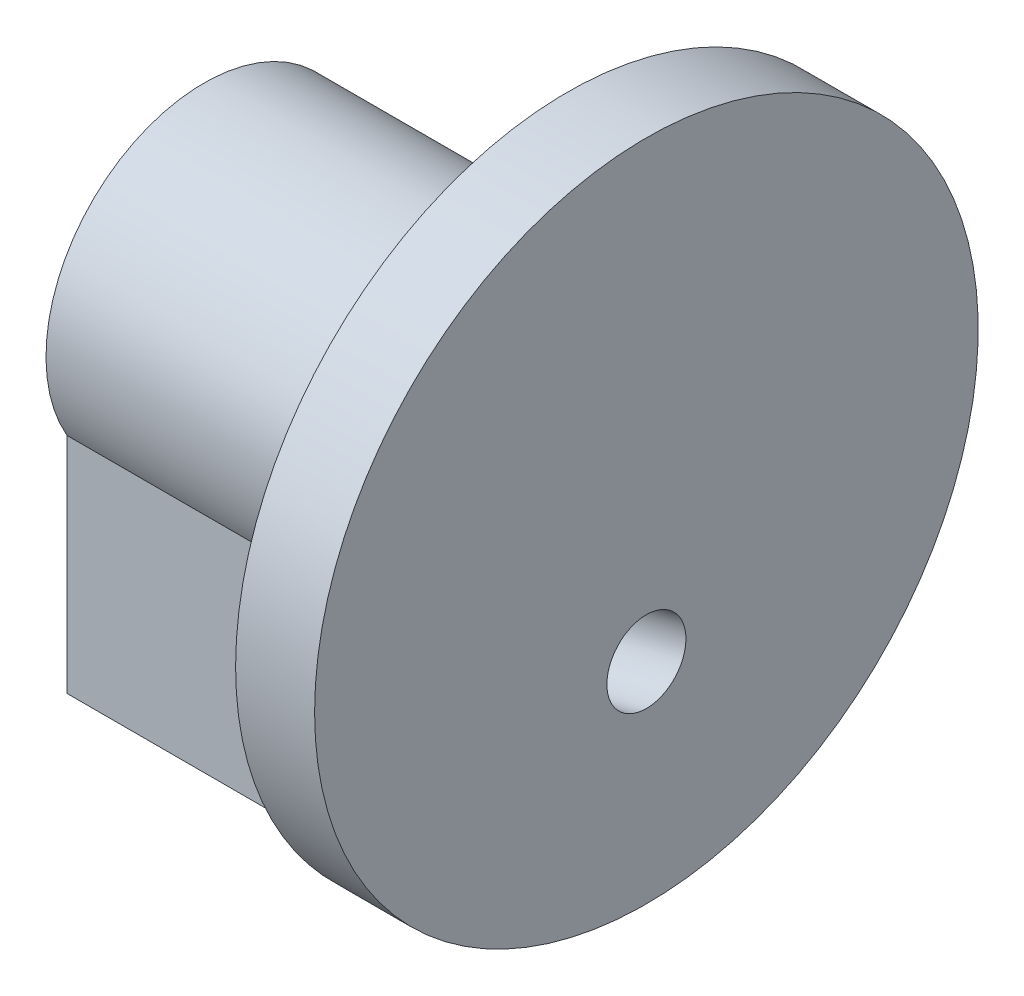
from build123d import *

# Parameters (mm, degrees)
ENL_V_MAT_EXTRU_1_DEPTH = 4.6
ESQUISSE3_R             = 0.5
ENL_V_MAT_EXTRU_2_DEPTH = 5.1


with BuildPart() as part:
    # Esquisse1 → R_volution1 (revolve)
    with BuildSketch(Plane.XY, mode=Mode.PRIVATE) as r_volution1_sk:
        Polygon((0, 0), (0, -3.5), (0, -4.2), (-5.6, -4.2), (-5.6, -0.75), (-1.5, -0.75), (-1.5, 0), align=None)
    revolve(r_volution1_sk.sketch.rotate(Axis((-1.5, 0, 0), (1, 0, 0)), 270), axis=Axis((-1.5, 0, 0), (1, 0, 0)))

    # Esquisse2 → Enl_v. mat.-Extru.1 (cut)
    with BuildSketch(Plane.ZY.offset(5.6)):
        with BuildLine():
            Line((-1.742936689, -0.980903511), (-1.742936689, -4.640579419))
            Line((-1.742936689, -4.640579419), (-5.424173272, -4.640579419))
            Line((-5.424173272, -4.640579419), (-5.424173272, 5.118518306))
            Line((-5.424173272, 5.118518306), (5.722686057, 5.118518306))
            Line((5.722686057, 5.118518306), (5.722686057, -4.640579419))
            Line((5.722686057, -4.640579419), (1.73393045, -4.640579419))
            Line((1.73393045, -4.640579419), (1.73393045, -0.996737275))
            ThreePointArc((1.73393045, -0.996737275), (0.009107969, 1.999979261), (-1.742936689, -0.980903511))
        make_face()
    extrude(amount=-ENL_V_MAT_EXTRU_1_DEPTH, mode=Mode.SUBTRACT)

    # Esquisse3 → Enl_v. mat.-Extru.2 (cut)
    with BuildSketch(Plane(origin=(0, 0, 0), x_dir=(0, 0, -1), z_dir=(-0.9723699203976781, -0.23344536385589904, 0))):
        with Locations(Location((0, 1.5, 0), (0, 0, 270))):
            Circle(ESQUISSE3_R)
    extrude(amount=ENL_V_MAT_EXTRU_2_DEPTH, mode=Mode.SUBTRACT)


solid = part.part
